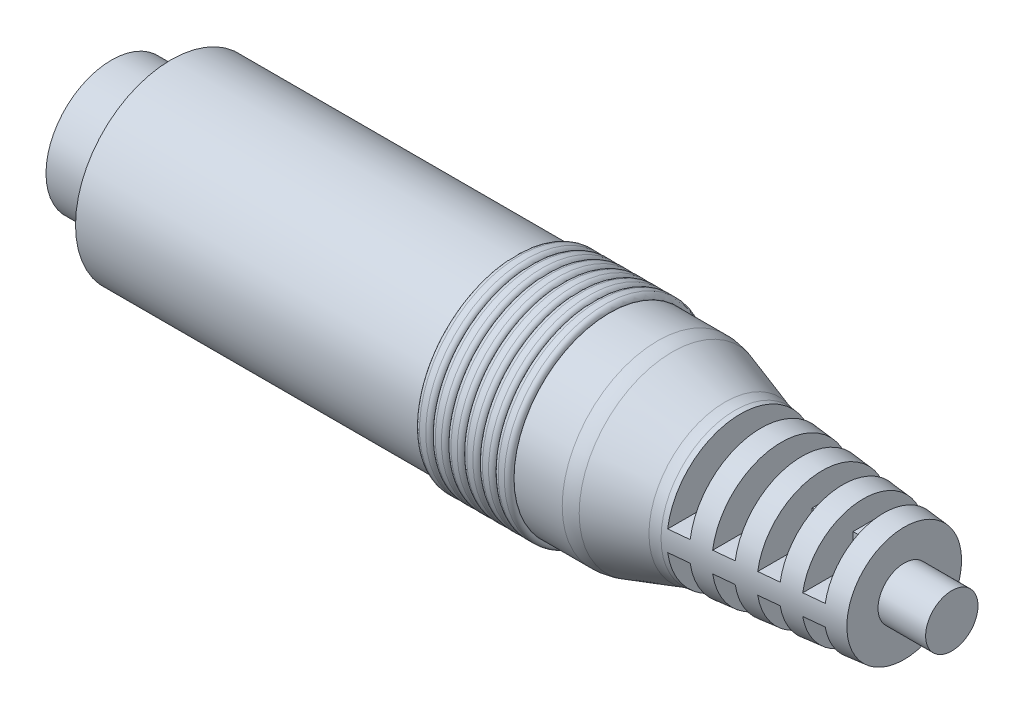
from build123d import *

# Parameters (mm, degrees)
SKETCH2_R          = 5.0927
EXTRUDE1_DEPTH     = 26.3652
SKETCH4_R          = 3.4925
EXTRUDE2_DEPTH     = 3.175
SKETCH5_R          = 1.8161
CUT_EXTRUDE1_DEPTH = 10.16
SKETCH6_R          = 5.0927
EXTRUDE3_DEPTH     = 3.4544
EXTRUDE3_TAPER     = 17.93
SKETCH7_R          = 3.974961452
EXTRUDE4_DEPTH     = 9.2964
EXTRUDE4_TAPER     = 5.618
LPATTERN1_COUNT    = 6
LPATTERN1_PITCH    = 0.8382
FILLET1_R          = 2.54
FILLET2_R          = 2.54
SKETCH10_R         = 1.397
EXTRUDE5_DEPTH     = 2.54
SKETCH11_W         = 1.0922
SKETCH11_H         = 3.808030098
SKETCH11_H_2       = 4.277710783
CUT_EXTRUDE2_DEPTH = 43.339918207
LPATTERN3_COUNT    = 4
LPATTERN3_PITCH    = 2.1844
SKETCH12_W         = 1.0922
SKETCH12_H         = 1.0922
EXTRUDE6_DEPTH     = 2.032
LPATTERN4_COUNT    = 4
LPATTERN4_PITCH    = 2.1844
SKETCH13_R         = 0.7239
EXTRUDE7_DEPTH     = 8.780212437
FILLET9_R          = 0.635


with BuildPart() as part:
    # Sketch2 → Extrude1 (new body)
    with BuildSketch(Plane(origin=(0, 0, 0), x_dir=(0, 0, -1), z_dir=(1, 0, 0))):
        Circle(SKETCH2_R)
    extrude(amount=EXTRUDE1_DEPTH)

    # Sketch4 → Extrude2 (add)
    with BuildSketch(Plane.ZY):
        with Locations(Location((0, 0, 0), (0, 0, 180))):
            Circle(SKETCH4_R)
    extrude(amount=EXTRUDE2_DEPTH)

    # Sketch5 → Cut-Extrude1 (cut)
    with BuildSketch(Plane.ZY.offset(3.175)):
        Circle(SKETCH5_R)
    extrude(amount=-CUT_EXTRUDE1_DEPTH, mode=Mode.SUBTRACT)

    # Sketch6 → Extrude3 (add)
    with BuildSketch(Plane(origin=(26.3652, 0, 0), x_dir=(0, 0, -1), z_dir=(1, 0, 0))):
        Circle(SKETCH6_R)
    extrude(amount=EXTRUDE3_DEPTH, taper=EXTRUDE3_TAPER)

    # Sketch7 → Extrude4 (add)
    with BuildSketch(Plane(origin=(29.8196, 0, 0), x_dir=(0, 0, -1), z_dir=(1, 0, 0))):
        Circle(SKETCH7_R)
    extrude(amount=EXTRUDE4_DEPTH, taper=EXTRUDE4_TAPER)

    # Sketch9 → Revolve1 (revolve)
    with BuildSketch(Plane.XY, mode=Mode.PRIVATE) as revolve1_sk:
        with BuildLine():
            Line((22.5552, 5.0927), (23.3934, 5.0927))
            Line((23.3934, 5.0927), (23.3934, 5.1054))
            ThreePointArc((23.3934, 5.1054), (23.319005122, 5.285005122), (23.1394, 5.3594))
            Line((23.1394, 5.3594), (22.8092, 5.3594))
            ThreePointArc((22.8092, 5.3594), (22.629594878, 5.285005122), (22.5552, 5.1054))
            Line((22.5552, 5.1054), (22.5552, 5.0927))
        make_face()
    revolve1 = revolve(revolve1_sk.sketch.rotate(Axis((39.116, 0, 0), (-1, 0, 0)), 90), axis=Axis((39.116, 0, 0), (-1, 0, 0)))

    # LPattern1: Revolve1 ×6
    with Locations(*[(-i * LPATTERN1_PITCH, 0, 0) for i in range(1, LPATTERN1_COUNT)]):
        add(revolve1)

    # Fillet1
    fillet1_edges = [part.edges().sort_by_distance(p)[0] for p in [
        (26.3652, 0, 5.0927),
    ]]
    fillet(fillet1_edges, radius=FILLET1_R)

    # Fillet2
    fillet2_edges = [part.edges().sort_by_distance(p)[0] for p in [
        (29.8196, 0, 3.974961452),
    ]]
    fillet(fillet2_edges, radius=FILLET2_R)

    # Sketch10 → Extrude5 (add)
    with BuildSketch(Plane(origin=(39.116, 0, 0), x_dir=(0, 0, -1), z_dir=(1, 0, 0))):
        Circle(SKETCH10_R)
    extrude(amount=EXTRUDE5_DEPTH)

    # Sketch11 → Cut-Extrude2 (cut, symmetric)
    with BuildSketch(Plane.XY):
        with Locations((37.4777, 2.450115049)):
            Rectangle(SKETCH11_W, SKETCH11_H)
        with Locations((37.4777, -2.684955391)):
            Rectangle(SKETCH11_W, SKETCH11_H_2)
    cut_extrude2 = extrude(amount=CUT_EXTRUDE2_DEPTH, both=True, mode=Mode.SUBTRACT)

    # LPattern3: Cut-Extrude2 ×4
    with Locations(*[(-i * LPATTERN3_PITCH, 0, 0) for i in range(1, LPATTERN3_COUNT)]):
        add(cut_extrude2, mode=Mode.SUBTRACT)

    # Sketch12 → Extrude6 (add, symmetric)
    with BuildSketch(Plane(origin=(0, 0, 0), x_dir=(1, 0, 0), z_dir=(0, 1, 0))):
        with Locations((37.4777, 0)):
            Rectangle(SKETCH12_W, SKETCH12_H)
    extrude6 = extrude(amount=EXTRUDE6_DEPTH, both=True)

    # LPattern4: Extrude6 ×4
    with Locations(*[(-i * LPATTERN4_PITCH, 0, 0) for i in range(1, LPATTERN4_COUNT)]):
        add(extrude6)

    # Sketch13 → Extrude7 (add)
    with BuildSketch(Plane.ZY.offset(-6.985)):
        Circle(SKETCH13_R)
    extrude(amount=EXTRUDE7_DEPTH)

    # Fillet9
    fillet9_edges = [part.edges().sort_by_distance(p)[0] for p in [
        (-1.795212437, 0, -0.7239),
    ]]
    fillet(fillet9_edges, radius=FILLET9_R)


solid = part.part
